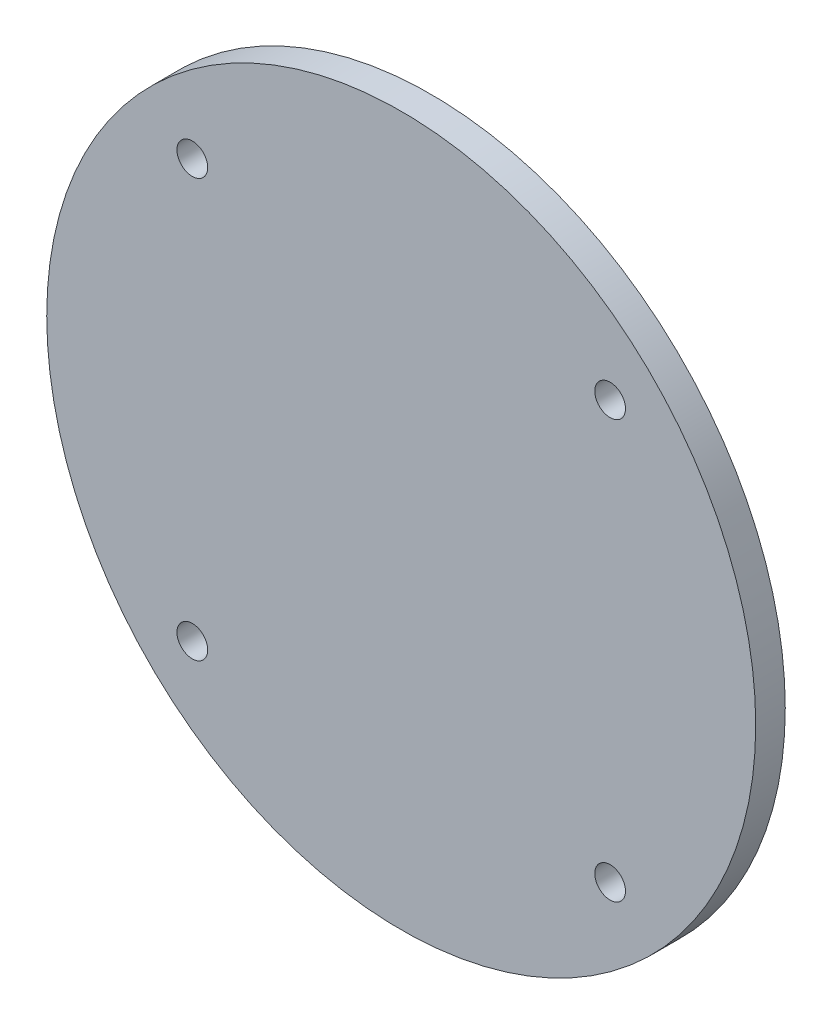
ISO-10303-21;
HEADER;
FILE_DESCRIPTION(('STEP AP214'),'2;1');
FILE_NAME('part.step','',(''),(''),'','','');
FILE_SCHEMA(('AUTOMOTIVE_DESIGN { 1 0 10303 214 1 1 1 1 }'));
ENDSEC;
DATA;
#1=APPLICATION_CONTEXT('core data for automotive mechanical design processes');
#2=APPLICATION_PROTOCOL_DEFINITION('international standard','automotive_design',2000,#1);
#3=PRODUCT_CONTEXT('',#1,'mechanical');
#4=PRODUCT('Part','Part','',(#3));
#5=PRODUCT_RELATED_PRODUCT_CATEGORY('part','',(#4));
#6=PRODUCT_DEFINITION_FORMATION('','',#4);
#7=PRODUCT_DEFINITION_CONTEXT('part definition',#1,'design');
#8=PRODUCT_DEFINITION('design','',#6,#7);
#9=PRODUCT_DEFINITION_SHAPE('','',#8);
#10=(LENGTH_UNIT() NAMED_UNIT(*) SI_UNIT(.MILLI.,.METRE.));
#11=(NAMED_UNIT(*) PLANE_ANGLE_UNIT() SI_UNIT($,.RADIAN.));
#12=(NAMED_UNIT(*) SI_UNIT($,.STERADIAN.) SOLID_ANGLE_UNIT());
#13=UNCERTAINTY_MEASURE_WITH_UNIT(LENGTH_MEASURE(1.E-05),#10,'distance_accuracy_value','');
#14=(GEOMETRIC_REPRESENTATION_CONTEXT(3) GLOBAL_UNCERTAINTY_ASSIGNED_CONTEXT((#13)) GLOBAL_UNIT_ASSIGNED_CONTEXT((#10,
#11,#12)) REPRESENTATION_CONTEXT('',''));
#15=CARTESIAN_POINT('',(0.,0.,0.));
#16=DIRECTION('',(0.,0.,1.));
#17=DIRECTION('',(1.,0.,0.));
#18=AXIS2_PLACEMENT_3D('',#15,#16,#17);
#19=CARTESIAN_POINT('',(0.,0.,6.35));
#20=DIRECTION('',(0.,0.,-1.));
#21=DIRECTION('',(-1.,0.,0.));
#22=AXIS2_PLACEMENT_3D('',#19,#20,#21);
#23=CYLINDRICAL_SURFACE('',#22,76.2);
#24=CARTESIAN_POINT('',(0.,0.,6.35));
#25=DIRECTION('',(0.,0.,1.));
#26=DIRECTION('',(1.,0.,0.));
#27=AXIS2_PLACEMENT_3D('',#24,#25,#26);
#28=CIRCLE('',#27,76.2);
#29=CARTESIAN_POINT('',(76.2,0.,6.35));
#30=VERTEX_POINT('',#29);
#31=EDGE_CURVE('E10',#30,#30,#28,.T.);
#32=ORIENTED_EDGE('',*,*,#31,.F.);
#33=EDGE_LOOP('',(#32));
#34=FACE_BOUND('',#33,.T.);
#35=CARTESIAN_POINT('',(0.,0.,0.));
#36=DIRECTION('',(0.,0.,1.));
#37=DIRECTION('',(1.,0.,0.));
#38=AXIS2_PLACEMENT_3D('',#35,#36,#37);
#39=CIRCLE('',#38,76.2);
#40=CARTESIAN_POINT('',(76.2,0.,0.));
#41=VERTEX_POINT('',#40);
#42=EDGE_CURVE('E32',#41,#41,#39,.T.);
#43=ORIENTED_EDGE('',*,*,#42,.T.);
#44=EDGE_LOOP('',(#43));
#45=FACE_BOUND('',#44,.T.);
#46=ADVANCED_FACE('F29',(#34,#45),#23,.T.);
#47=CARTESIAN_POINT('',(0.,0.,6.35));
#48=DIRECTION('',(0.,0.,1.));
#49=DIRECTION('',(1.,0.,0.));
#50=AXIS2_PLACEMENT_3D('',#47,#48,#49);
#51=PLANE('',#50);
#52=CARTESIAN_POINT('',(44.9012806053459,44.9012806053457,6.35));
#53=DIRECTION('',(0.,0.,1.));
#54=DIRECTION('',(1.,0.,0.));
#55=AXIS2_PLACEMENT_3D('',#52,#53,#54);
#56=CIRCLE('',#55,3.302);
#57=CARTESIAN_POINT('',(48.2032806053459,44.9012806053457,6.35));
#58=VERTEX_POINT('',#57);
#59=EDGE_CURVE('E59',#58,#58,#56,.T.);
#60=ORIENTED_EDGE('',*,*,#59,.F.);
#61=EDGE_LOOP('',(#60));
#62=FACE_BOUND('',#61,.T.);
#63=CARTESIAN_POINT('',(44.9012806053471,-44.9012806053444,6.35));
#64=DIRECTION('',(0.,0.,1.));
#65=DIRECTION('',(1.,0.,0.));
#66=AXIS2_PLACEMENT_3D('',#63,#64,#65);
#67=CIRCLE('',#66,3.30200000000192);
#68=CARTESIAN_POINT('',(48.203280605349,-44.9012806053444,6.35));
#69=VERTEX_POINT('',#68);
#70=EDGE_CURVE('E53',#69,#69,#67,.T.);
#71=ORIENTED_EDGE('',*,*,#70,.F.);
#72=EDGE_LOOP('',(#71));
#73=FACE_BOUND('',#72,.T.);
#74=CARTESIAN_POINT('',(-44.9012806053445,-44.9012806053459,6.35));
#75=DIRECTION('',(0.,0.,1.));
#76=DIRECTION('',(1.,0.,0.));
#77=AXIS2_PLACEMENT_3D('',#74,#75,#76);
#78=CIRCLE('',#77,3.30200000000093);
#79=CARTESIAN_POINT('',(-41.5992806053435,-44.9012806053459,6.35));
#80=VERTEX_POINT('',#79);
#81=EDGE_CURVE('E47',#80,#80,#78,.T.);
#82=ORIENTED_EDGE('',*,*,#81,.F.);
#83=EDGE_LOOP('',(#82));
#84=FACE_BOUND('',#83,.T.);
#85=CARTESIAN_POINT('',(-44.9012806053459,44.9012806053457,6.35));
#86=DIRECTION('',(0.,0.,1.));
#87=DIRECTION('',(1.,0.,0.));
#88=AXIS2_PLACEMENT_3D('',#85,#86,#87);
#89=CIRCLE('',#88,3.302);
#90=CARTESIAN_POINT('',(-41.5992806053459,44.9012806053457,6.35));
#91=VERTEX_POINT('',#90);
#92=EDGE_CURVE('E41',#91,#91,#89,.T.);
#93=ORIENTED_EDGE('',*,*,#92,.F.);
#94=EDGE_LOOP('',(#93));
#95=FACE_BOUND('',#94,.T.);
#96=ORIENTED_EDGE('',*,*,#31,.T.);
#97=EDGE_LOOP('',(#96));
#98=FACE_BOUND('',#97,.T.);
#99=ADVANCED_FACE('F75',(#62,#73,#84,#95,#98),#51,.T.);
#100=CARTESIAN_POINT('',(0.,0.,0.));
#101=DIRECTION('',(0.,0.,1.));
#102=DIRECTION('',(1.,0.,0.));
#103=AXIS2_PLACEMENT_3D('',#100,#101,#102);
#104=PLANE('',#103);
#105=CARTESIAN_POINT('',(44.9012806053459,44.9012806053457,0.));
#106=DIRECTION('',(0.,0.,1.));
#107=DIRECTION('',(1.,0.,0.));
#108=AXIS2_PLACEMENT_3D('',#105,#106,#107);
#109=CIRCLE('',#108,3.302);
#110=CARTESIAN_POINT('',(48.2032806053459,44.9012806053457,0.));
#111=VERTEX_POINT('',#110);
#112=EDGE_CURVE('E56',#111,#111,#109,.T.);
#113=ORIENTED_EDGE('',*,*,#112,.T.);
#114=EDGE_LOOP('',(#113));
#115=FACE_BOUND('',#114,.T.);
#116=CARTESIAN_POINT('',(44.9012806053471,-44.9012806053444,0.));
#117=DIRECTION('',(0.,0.,1.));
#118=DIRECTION('',(1.,0.,0.));
#119=AXIS2_PLACEMENT_3D('',#116,#117,#118);
#120=CIRCLE('',#119,3.30200000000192);
#121=CARTESIAN_POINT('',(48.203280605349,-44.9012806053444,0.));
#122=VERTEX_POINT('',#121);
#123=EDGE_CURVE('E50',#122,#122,#120,.T.);
#124=ORIENTED_EDGE('',*,*,#123,.T.);
#125=EDGE_LOOP('',(#124));
#126=FACE_BOUND('',#125,.T.);
#127=CARTESIAN_POINT('',(-44.9012806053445,-44.9012806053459,0.));
#128=DIRECTION('',(0.,0.,1.));
#129=DIRECTION('',(1.,0.,0.));
#130=AXIS2_PLACEMENT_3D('',#127,#128,#129);
#131=CIRCLE('',#130,3.30200000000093);
#132=CARTESIAN_POINT('',(-41.5992806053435,-44.9012806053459,0.));
#133=VERTEX_POINT('',#132);
#134=EDGE_CURVE('E44',#133,#133,#131,.T.);
#135=ORIENTED_EDGE('',*,*,#134,.T.);
#136=EDGE_LOOP('',(#135));
#137=FACE_BOUND('',#136,.T.);
#138=CARTESIAN_POINT('',(-44.9012806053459,44.9012806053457,0.));
#139=DIRECTION('',(0.,0.,1.));
#140=DIRECTION('',(1.,0.,0.));
#141=AXIS2_PLACEMENT_3D('',#138,#139,#140);
#142=CIRCLE('',#141,3.302);
#143=CARTESIAN_POINT('',(-41.5992806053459,44.9012806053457,0.));
#144=VERTEX_POINT('',#143);
#145=EDGE_CURVE('E39',#144,#144,#142,.T.);
#146=ORIENTED_EDGE('',*,*,#145,.T.);
#147=EDGE_LOOP('',(#146));
#148=FACE_BOUND('',#147,.T.);
#149=ORIENTED_EDGE('',*,*,#42,.F.);
#150=EDGE_LOOP('',(#149));
#151=FACE_BOUND('',#150,.T.);
#152=ADVANCED_FACE('F65',(#115,#126,#137,#148,#151),#104,.F.);
#153=CARTESIAN_POINT('',(-44.9012806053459,44.9012806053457,0.));
#154=DIRECTION('',(0.,0.,1.));
#155=DIRECTION('',(1.,0.,0.));
#156=AXIS2_PLACEMENT_3D('',#153,#154,#155);
#157=CYLINDRICAL_SURFACE('',#156,3.302);
#158=ORIENTED_EDGE('',*,*,#145,.F.);
#159=EDGE_LOOP('',(#158));
#160=FACE_BOUND('',#159,.T.);
#161=ORIENTED_EDGE('',*,*,#92,.T.);
#162=EDGE_LOOP('',(#161));
#163=FACE_BOUND('',#162,.T.);
#164=ADVANCED_FACE('F85',(#160,#163),#157,.F.);
#165=CARTESIAN_POINT('',(-44.9012806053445,-44.9012806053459,0.));
#166=DIRECTION('',(0.,0.,1.));
#167=DIRECTION('',(1.,0.,0.));
#168=AXIS2_PLACEMENT_3D('',#165,#166,#167);
#169=CYLINDRICAL_SURFACE('',#168,3.30200000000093);
#170=ORIENTED_EDGE('',*,*,#134,.F.);
#171=EDGE_LOOP('',(#170));
#172=FACE_BOUND('',#171,.T.);
#173=ORIENTED_EDGE('',*,*,#81,.T.);
#174=EDGE_LOOP('',(#173));
#175=FACE_BOUND('',#174,.T.);
#176=ADVANCED_FACE('F87',(#172,#175),#169,.F.);
#177=CARTESIAN_POINT('',(44.9012806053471,-44.9012806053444,0.));
#178=DIRECTION('',(0.,0.,1.));
#179=DIRECTION('',(1.,0.,0.));
#180=AXIS2_PLACEMENT_3D('',#177,#178,#179);
#181=CYLINDRICAL_SURFACE('',#180,3.30200000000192);
#182=ORIENTED_EDGE('',*,*,#123,.F.);
#183=EDGE_LOOP('',(#182));
#184=FACE_BOUND('',#183,.T.);
#185=ORIENTED_EDGE('',*,*,#70,.T.);
#186=EDGE_LOOP('',(#185));
#187=FACE_BOUND('',#186,.T.);
#188=ADVANCED_FACE('F71',(#184,#187),#181,.F.);
#189=CARTESIAN_POINT('',(44.9012806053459,44.9012806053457,0.));
#190=DIRECTION('',(0.,0.,1.));
#191=DIRECTION('',(1.,0.,0.));
#192=AXIS2_PLACEMENT_3D('',#189,#190,#191);
#193=CYLINDRICAL_SURFACE('',#192,3.302);
#194=ORIENTED_EDGE('',*,*,#112,.F.);
#195=EDGE_LOOP('',(#194));
#196=FACE_BOUND('',#195,.T.);
#197=ORIENTED_EDGE('',*,*,#59,.T.);
#198=EDGE_LOOP('',(#197));
#199=FACE_BOUND('',#198,.T.);
#200=ADVANCED_FACE('F68',(#196,#199),#193,.F.);
#201=CLOSED_SHELL('',(#46,#99,#152,#164,#176,#188,#200));
#202=MANIFOLD_SOLID_BREP('B2',#201);
#203=ADVANCED_BREP_SHAPE_REPRESENTATION('',(#18,#202),#14);
#204=SHAPE_DEFINITION_REPRESENTATION(#9,#203);
ENDSEC;
END-ISO-10303-21;
